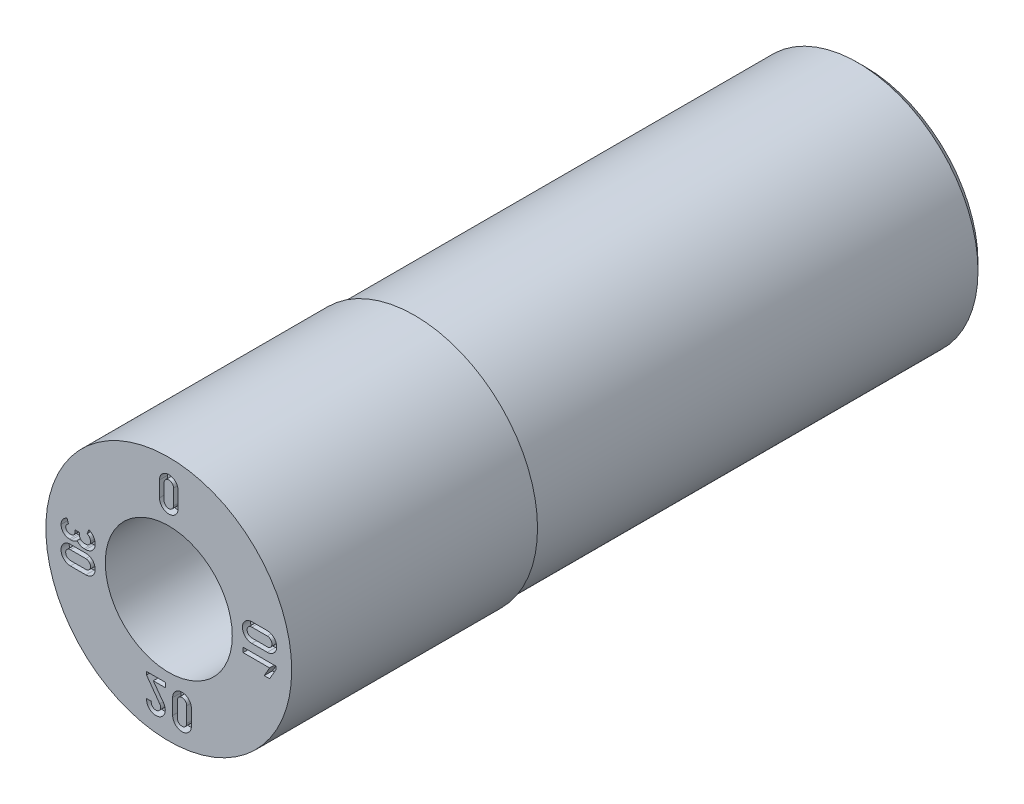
from build123d import *

# Parameters (mm, degrees)
SKETCH4_W          = 11
SKETCH4_H          = 1
CUT_EXTRUDE1_DEPTH = 0.2
CUT_EXTRUDE2_DEPTH = 1.4


with BuildPart() as part:
    # Sketch1 → Revolve1 (revolve)
    with BuildSketch(Plane(origin=(0, 0, 0), x_dir=(0, 0, -1), z_dir=(1, 0, 0)), mode=Mode.PRIVATE) as revolve1_sk:
        Polygon((0, 3), (0, 1.55), (2.8, 1.55), (2.8, 0.8), (14, 0.8), (14, 1.5), (17, 1.5), (17, 2.75), (16.75, 3), align=None)
    revolve(revolve1_sk.sketch.rotate(Axis((0, 0, 3.797909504), (0, 0, -1)), 90), axis=Axis((0, 0, 3.797909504), (0, 0, -1)))

    # Sketch4 → Cut-Revolve1 (revolve, cut)
    with BuildSketch(Plane(origin=(0, 0, 0), x_dir=(0, 0, -1), z_dir=(1, 0, 0)), mode=Mode.PRIVATE) as cut_revolve1_sk:
        with Locations((11.5, 3.435)):
            Rectangle(SKETCH4_W, SKETCH4_H)
    revolve(cut_revolve1_sk.sketch.rotate(Axis((0, 0, 0), (0, 0, -1)), 90), axis=Axis((0, 0, 0), (0, 0, -1)), mode=Mode.SUBTRACT)

    # Sketch2 → Cut-Extrude1 (cut)
    # profile 1 of 7: a face of its own
    with BuildSketch(Plane.XY):
        with BuildLine():
            Line((-2.400893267, -0.040572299), (-2.023400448, -0.040604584))
            ThreePointArc((-2.023400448, -0.040604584), (-1.794595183, -0.269439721), (-2.02343032, -0.498244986))
            Line((-2.02343032, -0.498244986), (-2.400932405, -0.498212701))
            ThreePointArc((-2.400932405, -0.498212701), (-2.629733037, -0.269372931), (-2.400893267, -0.040572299))
        make_face()
        with BuildLine():
            Line((-2.023415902, -0.38386691), (-2.400922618, -0.383770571))
            ThreePointArc((-2.400922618, -0.383770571), (-2.515290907, -0.269382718), (-2.400903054, -0.155014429))
            Line((-2.400903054, -0.155014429), (-2.023392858, -0.154982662))
            ThreePointArc((-2.023392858, -0.154982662), (-1.90897326, -0.269436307), (-2.023415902, -0.38386691))
        make_face(mode=Mode.SUBTRACT)
    # profile 2 of 7: a face of its own
    with BuildSketch(Plane.XY):
        with BuildLine():
            Line((-0.227844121, 2.405997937), (-0.227812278, 2.028505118))
            ThreePointArc((-0.227812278, 2.028505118), (0.001022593, 1.799686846), (0.229828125, 2.028534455))
            Line((0.229828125, 2.028534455), (0.229860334, 2.406036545))
            ThreePointArc((0.229860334, 2.406036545), (0.000988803, 2.634869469), (-0.227844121, 2.405997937))
        make_face()
        with BuildLine():
            Line((0.115418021, 2.028524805), (0.115386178, 2.406026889))
            ThreePointArc((0.115386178, 2.406026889), (0.000998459, 2.520395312), (-0.113369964, 2.406007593))
            Line((-0.113369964, 2.406007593), (-0.113402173, 2.028497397))
            ThreePointArc((-0.113402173, 2.028497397), (0.001021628, 1.91409695), (0.115418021, 2.028524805))
        make_face(mode=Mode.SUBTRACT)
    # profile 3 of 7: a face of its own
    with BuildSketch(Plane.XY):
        with BuildLine():
            Line((-0.085364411, -1.913551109), (-0.085374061, -1.799139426))
            Line((-0.085374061, -1.799139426), (-0.54295085, -1.799178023))
            Line((-0.54295085, -1.799178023), (-0.542944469, -1.874832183))
            Line((-0.542944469, -1.874832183), (-0.221232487, -2.321395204))
            ThreePointArc((-0.221232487, -2.321395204), (-0.287219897, -2.49950632), (-0.427201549, -2.371120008))
            Line((-0.427201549, -2.371120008), (-0.542262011, -2.371132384))
            ThreePointArc((-0.542262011, -2.371132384), (-0.251911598, -2.608448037), (-0.128264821, -2.254423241))
            Line((-0.128264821, -2.254423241), (-0.377090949, -1.913575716))
            Line((-0.377090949, -1.913575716), (-0.085364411, -1.913551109))
        make_face()
    # profile 4 of 7: a face of its own
    with BuildSketch(Plane.XY):
        Polygon((2.615450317, -0.107727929), (2.61545671, -0.183029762), (2.461448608, -0.450907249), (2.329518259, -0.45091845), (2.461012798, -0.222119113), (1.814717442, -0.222173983), (1.814707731, -0.107795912), align=None)
    # profile 5 of 7: a face of its own
    with BuildSketch(Plane.XY):
        with BuildLine():
            Line((2.404581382, 0.537339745), (2.027088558, 0.537371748))
            ThreePointArc((2.027088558, 0.537371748), (1.798270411, 0.308536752), (2.027118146, 0.079731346))
            Line((2.027118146, 0.079731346), (2.40462023, 0.079763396))
            ThreePointArc((2.40462023, 0.079763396), (2.633388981, 0.308570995), (2.404581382, 0.537339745))
        make_face()
        with BuildLine():
            Line((2.027108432, 0.19414145), (2.404610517, 0.1941735))
            ThreePointArc((2.404610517, 0.1941735), (2.518978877, 0.308561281), (2.404591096, 0.422929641))
            Line((2.404591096, 0.422929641), (2.027080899, 0.422961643))
            ThreePointArc((2.027080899, 0.422961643), (1.912680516, 0.308537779), (2.027108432, 0.19414145))
        make_face(mode=Mode.SUBTRACT)
    # profile 6 of 7: a face of its own
    with BuildSketch(Plane.XY):
        with BuildLine():
            Line((-2.023123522, 0.150203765), (-2.06316166, 0.150207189))
            ThreePointArc((-2.06316166, 0.150207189), (-2.144026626, 0.183710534), (-2.17751628, 0.26458117))
            Line((-2.17751628, 0.26458117), (-2.177511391, 0.32176806))
            Line((-2.177511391, 0.32176806), (-2.291921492, 0.321777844))
            Line((-2.291921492, 0.321777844), (-2.291926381, 0.264604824))
            ThreePointArc((-2.291926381, 0.264604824), (-2.318734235, 0.199900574), (-2.38344307, 0.173103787))
            Line((-2.38344307, 0.173103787), (-2.423475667, 0.173107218))
            ThreePointArc((-2.423475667, 0.173107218), (-2.488157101, 0.199937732), (-2.514981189, 0.264621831))
            ThreePointArc((-2.514981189, 0.264621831), (-2.495695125, 0.324660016), (-2.444987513, 0.362147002))
            Line((-2.444987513, 0.362147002), (-2.481588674, 0.470540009))
            ThreePointArc((-2.481588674, 0.470540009), (-2.588588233, 0.391357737), (-2.629377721, 0.264649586))
            ThreePointArc((-2.629377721, 0.264649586), (-2.56909136, 0.119018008), (-2.423474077, 0.058697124))
            Line((-2.423474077, 0.058697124), (-2.383452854, 0.058693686))
            ThreePointArc((-2.383452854, 0.058693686), (-2.30529754, 0.074102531), (-2.238846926, 0.118034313))
            ThreePointArc((-2.238846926, 0.118034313), (-2.160157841, 0.057366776), (-2.063166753, 0.035797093))
            Line((-2.063166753, 0.035797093), (-2.023113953, 0.035793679))
            ThreePointArc((-2.023113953, 0.035793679), (-1.861346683, 0.102790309), (-1.794344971, 0.264555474))
            ThreePointArc((-1.794344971, 0.264555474), (-1.836955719, 0.402924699), (-1.950014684, 0.493364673))
            Line((-1.950014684, 0.493364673), (-1.991996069, 0.386985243))
            ThreePointArc((-1.991996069, 0.386985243), (-1.931512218, 0.338607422), (-1.90872301, 0.264584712))
            ThreePointArc((-1.90872301, 0.264584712), (-1.942234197, 0.183701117), (-2.023123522, 0.150203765))
        make_face()
    # profile 7 of 7: a face of its own
    with BuildSketch(Plane.XY):
        with BuildLine():
            Line((0.55231775, -2.409911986), (0.552349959, -2.032405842))
            ThreePointArc((0.552349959, -2.032405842), (0.323515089, -1.803604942), (0.094709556, -2.032435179))
            Line((0.094709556, -2.032435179), (0.094741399, -2.409937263))
            ThreePointArc((0.094741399, -2.409937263), (0.323542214, -2.63871946), (0.55231775, -2.409911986))
        make_face()
        with BuildLine():
            Line((0.209119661, -2.032438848), (0.209151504, -2.409940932))
            ThreePointArc((0.209151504, -2.409940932), (0.323539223, -2.524309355), (0.437907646, -2.409921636))
            Line((0.437907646, -2.409921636), (0.437939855, -2.03241144))
            ThreePointArc((0.437939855, -2.03241144), (0.323516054, -1.918015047), (0.209119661, -2.032438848))
        make_face(mode=Mode.SUBTRACT)
    extrude(amount=-CUT_EXTRUDE1_DEPTH, mode=Mode.SUBTRACT)

    # Sketch3 → Cut-Extrude2 (cut)
    with BuildSketch(Plane.XY.offset(-2.8)):
        Polygon((0.461880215, 0.8), (-0.461880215, 0.8), (-0.923760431, 0), (-0.461880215, -0.8), (0.461880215, -0.8), (0.923760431, 0), align=None)
    extrude(amount=-CUT_EXTRUDE2_DEPTH, mode=Mode.SUBTRACT)


solid = part.part
